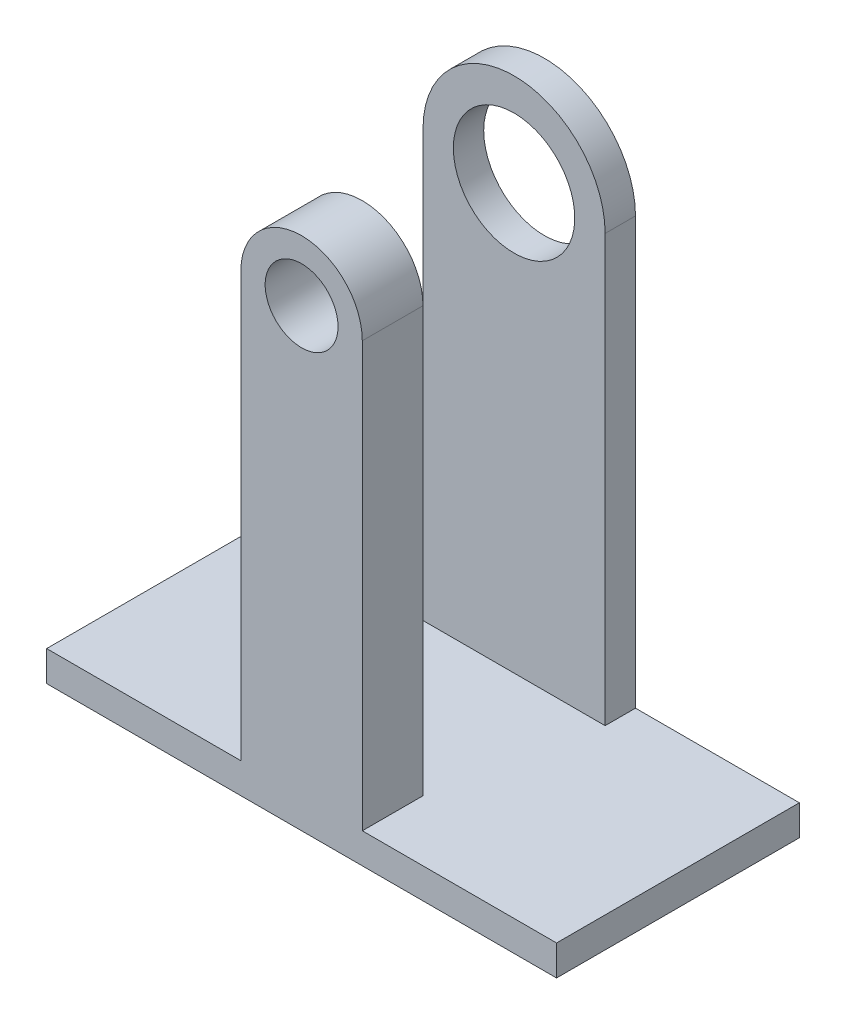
ISO-10303-21;
HEADER;
FILE_DESCRIPTION(('STEP AP214'),'2;1');
FILE_NAME('part.step','',(''),(''),'','','');
FILE_SCHEMA(('AUTOMOTIVE_DESIGN { 1 0 10303 214 1 1 1 1 }'));
ENDSEC;
DATA;
#1=APPLICATION_CONTEXT('core data for automotive mechanical design processes');
#2=APPLICATION_PROTOCOL_DEFINITION('international standard','automotive_design',2000,#1);
#3=PRODUCT_CONTEXT('',#1,'mechanical');
#4=PRODUCT('Part','Part','',(#3));
#5=PRODUCT_RELATED_PRODUCT_CATEGORY('part','',(#4));
#6=PRODUCT_DEFINITION_FORMATION('','',#4);
#7=PRODUCT_DEFINITION_CONTEXT('part definition',#1,'design');
#8=PRODUCT_DEFINITION('design','',#6,#7);
#9=PRODUCT_DEFINITION_SHAPE('','',#8);
#10=(LENGTH_UNIT() NAMED_UNIT(*) SI_UNIT(.MILLI.,.METRE.));
#11=(NAMED_UNIT(*) PLANE_ANGLE_UNIT() SI_UNIT($,.RADIAN.));
#12=(NAMED_UNIT(*) SI_UNIT($,.STERADIAN.) SOLID_ANGLE_UNIT());
#13=UNCERTAINTY_MEASURE_WITH_UNIT(LENGTH_MEASURE(1.E-05),#10,'distance_accuracy_value','');
#14=(GEOMETRIC_REPRESENTATION_CONTEXT(3) GLOBAL_UNCERTAINTY_ASSIGNED_CONTEXT((#13)) GLOBAL_UNIT_ASSIGNED_CONTEXT((#10,
#11,#12)) REPRESENTATION_CONTEXT('',''));
#15=CARTESIAN_POINT('',(0.,0.,0.));
#16=DIRECTION('',(0.,0.,1.));
#17=DIRECTION('',(1.,0.,0.));
#18=AXIS2_PLACEMENT_3D('',#15,#16,#17);
#19=CARTESIAN_POINT('',(0.,0.,10.));
#20=DIRECTION('',(0.,0.,1.));
#21=DIRECTION('',(1.,0.,0.));
#22=AXIS2_PLACEMENT_3D('',#19,#20,#21);
#23=PLANE('',#22);
#24=DIRECTION('',(0.,-1.,0.));
#25=VECTOR('',#24,1.);
#26=CARTESIAN_POINT('',(-10.,0.,10.));
#27=LINE('',#26,#25);
#28=CARTESIAN_POINT('',(-10.,0.,10.));
#29=VERTEX_POINT('',#28);
#30=CARTESIAN_POINT('',(-9.99999999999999,-69.911627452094,10.));
#31=VERTEX_POINT('',#30);
#32=EDGE_CURVE('E207',#29,#31,#27,.T.);
#33=ORIENTED_EDGE('',*,*,#32,.T.);
#34=DIRECTION('',(-1.,0.,0.));
#35=VECTOR('',#34,1.);
#36=CARTESIAN_POINT('',(-42.,-69.911627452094,10.));
#37=LINE('',#36,#35);
#38=CARTESIAN_POINT('',(-42.,-69.911627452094,10.));
#39=VERTEX_POINT('',#38);
#40=EDGE_CURVE('E179',#31,#39,#37,.T.);
#41=ORIENTED_EDGE('',*,*,#40,.T.);
#42=DIRECTION('',(0.,-1.,0.));
#43=VECTOR('',#42,1.);
#44=CARTESIAN_POINT('',(-42.,-74.911627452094,10.));
#45=LINE('',#44,#43);
#46=CARTESIAN_POINT('',(-42.,-74.911627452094,10.));
#47=VERTEX_POINT('',#46);
#48=EDGE_CURVE('E170',#39,#47,#45,.T.);
#49=ORIENTED_EDGE('',*,*,#48,.T.);
#50=DIRECTION('',(1.,0.,0.));
#51=VECTOR('',#50,1.);
#52=CARTESIAN_POINT('',(-42.,-74.911627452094,10.));
#53=LINE('',#52,#51);
#54=CARTESIAN_POINT('',(42.,-74.911627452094,10.));
#55=VERTEX_POINT('',#54);
#56=EDGE_CURVE('E173',#47,#55,#53,.T.);
#57=ORIENTED_EDGE('',*,*,#56,.T.);
#58=DIRECTION('',(0.,1.,0.));
#59=VECTOR('',#58,1.);
#60=CARTESIAN_POINT('',(42.,-74.911627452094,10.));
#61=LINE('',#60,#59);
#62=CARTESIAN_POINT('',(42.,-69.911627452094,10.));
#63=VERTEX_POINT('',#62);
#64=EDGE_CURVE('E176',#55,#63,#61,.T.);
#65=ORIENTED_EDGE('',*,*,#64,.T.);
#66=CARTESIAN_POINT('',(10.,-69.911627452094,10.));
#67=VERTEX_POINT('',#66);
#68=EDGE_CURVE('E180',#63,#67,#37,.T.);
#69=ORIENTED_EDGE('',*,*,#68,.T.);
#70=DIRECTION('',(0.,1.,0.));
#71=VECTOR('',#70,1.);
#72=CARTESIAN_POINT('',(10.,0.,10.));
#73=LINE('',#72,#71);
#74=CARTESIAN_POINT('',(10.,0.,10.));
#75=VERTEX_POINT('',#74);
#76=EDGE_CURVE('E59',#67,#75,#73,.T.);
#77=ORIENTED_EDGE('',*,*,#76,.T.);
#78=CARTESIAN_POINT('',(0.,0.,10.));
#79=DIRECTION('',(0.,0.,1.));
#80=DIRECTION('',(1.,0.,0.));
#81=AXIS2_PLACEMENT_3D('',#78,#79,#80);
#82=CIRCLE('',#81,10.);
#83=EDGE_CURVE('E44',#75,#29,#82,.T.);
#84=ORIENTED_EDGE('',*,*,#83,.T.);
#85=EDGE_LOOP('',(#33,#41,#49,#57,#65,#69,#77,#84));
#86=FACE_BOUND('',#85,.T.);
#87=CARTESIAN_POINT('',(0.,0.,10.));
#88=DIRECTION('',(0.,0.,1.));
#89=DIRECTION('',(1.,0.,0.));
#90=AXIS2_PLACEMENT_3D('',#87,#88,#89);
#91=CIRCLE('',#90,6.);
#92=CARTESIAN_POINT('',(6.,0.,10.));
#93=VERTEX_POINT('',#92);
#94=EDGE_CURVE('E224',#93,#93,#91,.T.);
#95=ORIENTED_EDGE('',*,*,#94,.F.);
#96=EDGE_LOOP('',(#95));
#97=FACE_BOUND('',#96,.T.);
#98=ADVANCED_FACE('F36',(#86,#97),#23,.T.);
#99=CARTESIAN_POINT('',(0.,0.,0.));
#100=DIRECTION('',(0.,0.,1.));
#101=DIRECTION('',(1.,0.,0.));
#102=AXIS2_PLACEMENT_3D('',#99,#100,#101);
#103=PLANE('',#102);
#104=DIRECTION('',(0.,1.,0.));
#105=VECTOR('',#104,1.);
#106=CARTESIAN_POINT('',(10.,0.,0.));
#107=LINE('',#106,#105);
#108=CARTESIAN_POINT('',(10.,-69.911627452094,0.));
#109=VERTEX_POINT('',#108);
#110=CARTESIAN_POINT('',(10.,0.,0.));
#111=VERTEX_POINT('',#110);
#112=EDGE_CURVE('E214',#109,#111,#107,.T.);
#113=ORIENTED_EDGE('',*,*,#112,.F.);
#114=DIRECTION('',(-1.,0.,0.));
#115=VECTOR('',#114,1.);
#116=CARTESIAN_POINT('',(0.,-69.911627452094,0.));
#117=LINE('',#116,#115);
#118=CARTESIAN_POINT('',(-9.99999999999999,-69.911627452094,0.));
#119=VERTEX_POINT('',#118);
#120=EDGE_CURVE('E197',#109,#119,#117,.T.);
#121=ORIENTED_EDGE('',*,*,#120,.T.);
#122=DIRECTION('',(0.,-1.,0.));
#123=VECTOR('',#122,1.);
#124=CARTESIAN_POINT('',(-10.,0.,0.));
#125=LINE('',#124,#123);
#126=CARTESIAN_POINT('',(-10.,0.,0.));
#127=VERTEX_POINT('',#126);
#128=EDGE_CURVE('E211',#127,#119,#125,.T.);
#129=ORIENTED_EDGE('',*,*,#128,.F.);
#130=CARTESIAN_POINT('',(0.,0.,0.));
#131=DIRECTION('',(0.,0.,1.));
#132=DIRECTION('',(1.,0.,0.));
#133=AXIS2_PLACEMENT_3D('',#130,#131,#132);
#134=CIRCLE('',#133,10.);
#135=EDGE_CURVE('E228',#111,#127,#134,.T.);
#136=ORIENTED_EDGE('',*,*,#135,.F.);
#137=EDGE_LOOP('',(#113,#121,#129,#136));
#138=FACE_BOUND('',#137,.T.);
#139=CARTESIAN_POINT('',(0.,0.,0.));
#140=DIRECTION('',(0.,0.,1.));
#141=DIRECTION('',(1.,0.,0.));
#142=AXIS2_PLACEMENT_3D('',#139,#140,#141);
#143=CIRCLE('',#142,6.);
#144=CARTESIAN_POINT('',(6.,0.,0.));
#145=VERTEX_POINT('',#144);
#146=EDGE_CURVE('E219',#145,#145,#143,.T.);
#147=ORIENTED_EDGE('',*,*,#146,.T.);
#148=EDGE_LOOP('',(#147));
#149=FACE_BOUND('',#148,.T.);
#150=ADVANCED_FACE('F241',(#138,#149),#103,.F.);
#151=CARTESIAN_POINT('',(0.,0.,10.));
#152=DIRECTION('',(0.,0.,-1.));
#153=DIRECTION('',(-1.,0.,0.));
#154=AXIS2_PLACEMENT_3D('',#151,#152,#153);
#155=CYLINDRICAL_SURFACE('',#154,10.);
#156=ORIENTED_EDGE('',*,*,#83,.F.);
#157=DIRECTION('',(0.,0.,1.));
#158=VECTOR('',#157,1.);
#159=CARTESIAN_POINT('',(10.,0.,0.));
#160=LINE('',#159,#158);
#161=EDGE_CURVE('E217',#111,#75,#160,.T.);
#162=ORIENTED_EDGE('',*,*,#161,.F.);
#163=ORIENTED_EDGE('',*,*,#135,.T.);
#164=DIRECTION('',(0.,0.,1.));
#165=VECTOR('',#164,1.);
#166=CARTESIAN_POINT('',(-10.,0.,0.));
#167=LINE('',#166,#165);
#168=EDGE_CURVE('E216',#127,#29,#167,.T.);
#169=ORIENTED_EDGE('',*,*,#168,.T.);
#170=EDGE_LOOP('',(#156,#162,#163,#169));
#171=FACE_BOUND('',#170,.T.);
#172=ADVANCED_FACE('F38',(#171),#155,.T.);
#173=CARTESIAN_POINT('',(0.,0.,10.));
#174=DIRECTION('',(0.,0.,-1.));
#175=DIRECTION('',(-1.,0.,0.));
#176=AXIS2_PLACEMENT_3D('',#173,#174,#175);
#177=CYLINDRICAL_SURFACE('',#176,6.);
#178=ORIENTED_EDGE('',*,*,#94,.T.);
#179=EDGE_LOOP('',(#178));
#180=FACE_BOUND('',#179,.T.);
#181=ORIENTED_EDGE('',*,*,#146,.F.);
#182=EDGE_LOOP('',(#181));
#183=FACE_BOUND('',#182,.T.);
#184=ADVANCED_FACE('F250',(#180,#183),#177,.F.);
#185=CARTESIAN_POINT('',(10.,0.,0.));
#186=DIRECTION('',(1.,0.,0.));
#187=DIRECTION('',(0.,1.,0.));
#188=AXIS2_PLACEMENT_3D('',#185,#186,#187);
#189=PLANE('',#188);
#190=DIRECTION('',(0.,0.,1.));
#191=VECTOR('',#190,1.);
#192=CARTESIAN_POINT('',(10.,-69.911627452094,0.));
#193=LINE('',#192,#191);
#194=EDGE_CURVE('E205',#109,#67,#193,.T.);
#195=ORIENTED_EDGE('',*,*,#194,.F.);
#196=ORIENTED_EDGE('',*,*,#112,.T.);
#197=ORIENTED_EDGE('',*,*,#161,.T.);
#198=ORIENTED_EDGE('',*,*,#76,.F.);
#199=EDGE_LOOP('',(#195,#196,#197,#198));
#200=FACE_BOUND('',#199,.T.);
#201=ADVANCED_FACE('F248',(#200),#189,.T.);
#202=CARTESIAN_POINT('',(-10.,0.,0.));
#203=DIRECTION('',(-1.,0.,0.));
#204=DIRECTION('',(0.,-1.,0.));
#205=AXIS2_PLACEMENT_3D('',#202,#203,#204);
#206=PLANE('',#205);
#207=DIRECTION('',(0.,0.,-1.));
#208=VECTOR('',#207,1.);
#209=CARTESIAN_POINT('',(-9.99999999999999,-69.911627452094,0.));
#210=LINE('',#209,#208);
#211=EDGE_CURVE('E11',#31,#119,#210,.T.);
#212=ORIENTED_EDGE('',*,*,#211,.F.);
#213=ORIENTED_EDGE('',*,*,#32,.F.);
#214=ORIENTED_EDGE('',*,*,#168,.F.);
#215=ORIENTED_EDGE('',*,*,#128,.T.);
#216=EDGE_LOOP('',(#212,#213,#214,#215));
#217=FACE_BOUND('',#216,.T.);
#218=ADVANCED_FACE('F238',(#217),#206,.T.);
#219=CARTESIAN_POINT('',(-42.,-74.911627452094,-30.));
#220=DIRECTION('',(-1.,0.,0.));
#221=DIRECTION('',(0.,-1.,0.));
#222=AXIS2_PLACEMENT_3D('',#219,#220,#221);
#223=PLANE('',#222);
#224=ORIENTED_EDGE('',*,*,#48,.F.);
#225=DIRECTION('',(0.,0.,1.));
#226=VECTOR('',#225,1.);
#227=CARTESIAN_POINT('',(-42.,-69.911627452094,-30.));
#228=LINE('',#227,#226);
#229=CARTESIAN_POINT('',(-42.,-69.911627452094,-30.));
#230=VERTEX_POINT('',#229);
#231=EDGE_CURVE('E194',#230,#39,#228,.T.);
#232=ORIENTED_EDGE('',*,*,#231,.F.);
#233=DIRECTION('',(0.,-1.,0.));
#234=VECTOR('',#233,1.);
#235=CARTESIAN_POINT('',(-42.,-74.911627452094,-30.));
#236=LINE('',#235,#234);
#237=CARTESIAN_POINT('',(-42.,-74.911627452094,-30.));
#238=VERTEX_POINT('',#237);
#239=EDGE_CURVE('E182',#230,#238,#236,.T.);
#240=ORIENTED_EDGE('',*,*,#239,.T.);
#241=DIRECTION('',(0.,0.,1.));
#242=VECTOR('',#241,1.);
#243=CARTESIAN_POINT('',(-42.,-74.911627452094,-30.));
#244=LINE('',#243,#242);
#245=EDGE_CURVE('E193',#238,#47,#244,.T.);
#246=ORIENTED_EDGE('',*,*,#245,.T.);
#247=EDGE_LOOP('',(#224,#232,#240,#246));
#248=FACE_BOUND('',#247,.T.);
#249=ADVANCED_FACE('F256',(#248),#223,.T.);
#250=CARTESIAN_POINT('',(-42.,-69.911627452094,-30.));
#251=DIRECTION('',(0.,1.,0.));
#252=DIRECTION('',(0.,0.,1.));
#253=AXIS2_PLACEMENT_3D('',#250,#251,#252);
#254=PLANE('',#253);
#255=DIRECTION('',(0.,0.,-1.));
#256=VECTOR('',#255,1.);
#257=CARTESIAN_POINT('',(15.0037322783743,-69.911627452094,-30.));
#258=LINE('',#257,#256);
#259=CARTESIAN_POINT('',(15.0037322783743,-69.911627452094,-25.));
#260=VERTEX_POINT('',#259);
#261=CARTESIAN_POINT('',(15.0037322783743,-69.911627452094,-30.));
#262=VERTEX_POINT('',#261);
#263=EDGE_CURVE('E143',#260,#262,#258,.T.);
#264=ORIENTED_EDGE('',*,*,#263,.F.);
#265=DIRECTION('',(-1.,0.,0.));
#266=VECTOR('',#265,1.);
#267=CARTESIAN_POINT('',(-42.,-69.911627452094,-25.));
#268=LINE('',#267,#266);
#269=CARTESIAN_POINT('',(-14.9962677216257,-69.911627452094,-25.));
#270=VERTEX_POINT('',#269);
#271=EDGE_CURVE('E167',#260,#270,#268,.T.);
#272=ORIENTED_EDGE('',*,*,#271,.T.);
#273=DIRECTION('',(0.,0.,1.));
#274=VECTOR('',#273,1.);
#275=CARTESIAN_POINT('',(-14.9962677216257,-69.911627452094,-30.));
#276=LINE('',#275,#274);
#277=CARTESIAN_POINT('',(-14.9962677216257,-69.911627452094,-30.));
#278=VERTEX_POINT('',#277);
#279=EDGE_CURVE('E163',#278,#270,#276,.T.);
#280=ORIENTED_EDGE('',*,*,#279,.F.);
#281=DIRECTION('',(-1.,0.,0.));
#282=VECTOR('',#281,1.);
#283=CARTESIAN_POINT('',(-42.,-69.911627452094,-30.));
#284=LINE('',#283,#282);
#285=EDGE_CURVE('E190',#278,#230,#284,.T.);
#286=ORIENTED_EDGE('',*,*,#285,.T.);
#287=ORIENTED_EDGE('',*,*,#231,.T.);
#288=ORIENTED_EDGE('',*,*,#40,.F.);
#289=ORIENTED_EDGE('',*,*,#211,.T.);
#290=ORIENTED_EDGE('',*,*,#120,.F.);
#291=ORIENTED_EDGE('',*,*,#194,.T.);
#292=ORIENTED_EDGE('',*,*,#68,.F.);
#293=DIRECTION('',(0.,0.,1.));
#294=VECTOR('',#293,1.);
#295=CARTESIAN_POINT('',(42.,-69.911627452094,-30.));
#296=LINE('',#295,#294);
#297=CARTESIAN_POINT('',(42.,-69.911627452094,-30.));
#298=VERTEX_POINT('',#297);
#299=EDGE_CURVE('E198',#298,#63,#296,.T.);
#300=ORIENTED_EDGE('',*,*,#299,.F.);
#301=EDGE_CURVE('E191',#298,#262,#284,.T.);
#302=ORIENTED_EDGE('',*,*,#301,.T.);
#303=EDGE_LOOP('',(#264,#272,#280,#286,#287,#288,#289,#290,#291,#292,#300,#302));
#304=FACE_BOUND('',#303,.T.);
#305=ADVANCED_FACE('F245',(#304),#254,.T.);
#306=CARTESIAN_POINT('',(42.,-74.911627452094,-30.));
#307=DIRECTION('',(1.,0.,0.));
#308=DIRECTION('',(0.,1.,0.));
#309=AXIS2_PLACEMENT_3D('',#306,#307,#308);
#310=PLANE('',#309);
#311=ORIENTED_EDGE('',*,*,#64,.F.);
#312=DIRECTION('',(0.,0.,1.));
#313=VECTOR('',#312,1.);
#314=CARTESIAN_POINT('',(42.,-74.911627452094,-30.));
#315=LINE('',#314,#313);
#316=CARTESIAN_POINT('',(42.,-74.911627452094,-30.));
#317=VERTEX_POINT('',#316);
#318=EDGE_CURVE('E200',#317,#55,#315,.T.);
#319=ORIENTED_EDGE('',*,*,#318,.F.);
#320=DIRECTION('',(0.,1.,0.));
#321=VECTOR('',#320,1.);
#322=CARTESIAN_POINT('',(42.,-74.911627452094,-30.));
#323=LINE('',#322,#321);
#324=EDGE_CURVE('E187',#317,#298,#323,.T.);
#325=ORIENTED_EDGE('',*,*,#324,.T.);
#326=ORIENTED_EDGE('',*,*,#299,.T.);
#327=EDGE_LOOP('',(#311,#319,#325,#326));
#328=FACE_BOUND('',#327,.T.);
#329=ADVANCED_FACE('F358',(#328),#310,.T.);
#330=CARTESIAN_POINT('',(-42.,-74.911627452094,-30.));
#331=DIRECTION('',(0.,-1.,0.));
#332=DIRECTION('',(0.,0.,-1.));
#333=AXIS2_PLACEMENT_3D('',#330,#331,#332);
#334=PLANE('',#333);
#335=DIRECTION('',(1.,0.,0.));
#336=VECTOR('',#335,1.);
#337=CARTESIAN_POINT('',(-42.,-74.911627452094,-30.));
#338=LINE('',#337,#336);
#339=EDGE_CURVE('E185',#238,#317,#338,.T.);
#340=ORIENTED_EDGE('',*,*,#339,.T.);
#341=ORIENTED_EDGE('',*,*,#318,.T.);
#342=ORIENTED_EDGE('',*,*,#56,.F.);
#343=ORIENTED_EDGE('',*,*,#245,.F.);
#344=EDGE_LOOP('',(#340,#341,#342,#343));
#345=FACE_BOUND('',#344,.T.);
#346=ADVANCED_FACE('F295',(#345),#334,.T.);
#347=CARTESIAN_POINT('',(-42.,-69.911627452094,-30.));
#348=DIRECTION('',(0.,0.,-1.));
#349=DIRECTION('',(-1.,0.,0.));
#350=AXIS2_PLACEMENT_3D('',#347,#348,#349);
#351=PLANE('',#350);
#352=ORIENTED_EDGE('',*,*,#285,.F.);
#353=DIRECTION('',(0.,1.,0.));
#354=VECTOR('',#353,1.);
#355=CARTESIAN_POINT('',(-14.9962677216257,0.311059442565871,-30.));
#356=LINE('',#355,#354);
#357=CARTESIAN_POINT('',(-14.9962677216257,0.311059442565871,-30.));
#358=VERTEX_POINT('',#357);
#359=EDGE_CURVE('E137',#278,#358,#356,.T.);
#360=ORIENTED_EDGE('',*,*,#359,.T.);
#361=CARTESIAN_POINT('',(0.00373227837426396,0.311059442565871,-30.));
#362=DIRECTION('',(0.,0.,-1.));
#363=DIRECTION('',(-1.,0.,0.));
#364=AXIS2_PLACEMENT_3D('',#361,#362,#363);
#365=CIRCLE('',#364,15.);
#366=CARTESIAN_POINT('',(15.0037322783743,0.311059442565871,-30.));
#367=VERTEX_POINT('',#366);
#368=EDGE_CURVE('E132',#358,#367,#365,.T.);
#369=ORIENTED_EDGE('',*,*,#368,.T.);
#370=DIRECTION('',(0.,-1.,0.));
#371=VECTOR('',#370,1.);
#372=CARTESIAN_POINT('',(15.0037322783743,0.311059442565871,-30.));
#373=LINE('',#372,#371);
#374=EDGE_CURVE('E140',#367,#262,#373,.T.);
#375=ORIENTED_EDGE('',*,*,#374,.T.);
#376=ORIENTED_EDGE('',*,*,#301,.F.);
#377=ORIENTED_EDGE('',*,*,#324,.F.);
#378=ORIENTED_EDGE('',*,*,#339,.F.);
#379=ORIENTED_EDGE('',*,*,#239,.F.);
#380=EDGE_LOOP('',(#352,#360,#369,#375,#376,#377,#378,#379));
#381=FACE_BOUND('',#380,.T.);
#382=CARTESIAN_POINT('',(0.,0.,-30.));
#383=DIRECTION('',(0.,0.,-1.));
#384=DIRECTION('',(-1.,0.,0.));
#385=AXIS2_PLACEMENT_3D('',#382,#383,#384);
#386=CIRCLE('',#385,10.);
#387=CARTESIAN_POINT('',(-10.,0.,-30.));
#388=VERTEX_POINT('',#387);
#389=EDGE_CURVE('E152',#388,#388,#386,.T.);
#390=ORIENTED_EDGE('',*,*,#389,.F.);
#391=EDGE_LOOP('',(#390));
#392=FACE_BOUND('',#391,.T.);
#393=ADVANCED_FACE('F149',(#381,#392),#351,.T.);
#394=CARTESIAN_POINT('',(15.0037322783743,0.311059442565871,70.0796152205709));
#395=DIRECTION('',(1.,0.,0.));
#396=DIRECTION('',(0.,1.,0.));
#397=AXIS2_PLACEMENT_3D('',#394,#395,#396);
#398=PLANE('',#397);
#399=DIRECTION('',(0.,1.,0.));
#400=VECTOR('',#399,1.);
#401=CARTESIAN_POINT('',(15.0037322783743,0.311059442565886,-25.));
#402=LINE('',#401,#400);
#403=CARTESIAN_POINT('',(15.0037322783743,0.311059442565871,-25.));
#404=VERTEX_POINT('',#403);
#405=EDGE_CURVE('E164',#260,#404,#402,.T.);
#406=ORIENTED_EDGE('',*,*,#405,.F.);
#407=ORIENTED_EDGE('',*,*,#263,.T.);
#408=ORIENTED_EDGE('',*,*,#374,.F.);
#409=DIRECTION('',(0.,0.,-1.));
#410=VECTOR('',#409,1.);
#411=CARTESIAN_POINT('',(15.0037322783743,0.311059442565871,70.0796152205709));
#412=LINE('',#411,#410);
#413=EDGE_CURVE('E127',#404,#367,#412,.T.);
#414=ORIENTED_EDGE('',*,*,#413,.F.);
#415=EDGE_LOOP('',(#406,#407,#408,#414));
#416=FACE_BOUND('',#415,.T.);
#417=ADVANCED_FACE('F141',(#416),#398,.T.);
#418=CARTESIAN_POINT('',(-14.9962677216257,0.311059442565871,70.0796152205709));
#419=DIRECTION('',(-1.,0.,0.));
#420=DIRECTION('',(0.,0.,1.));
#421=AXIS2_PLACEMENT_3D('',#418,#419,#420);
#422=PLANE('',#421);
#423=ORIENTED_EDGE('',*,*,#359,.F.);
#424=ORIENTED_EDGE('',*,*,#279,.T.);
#425=DIRECTION('',(0.,-1.,0.));
#426=VECTOR('',#425,1.);
#427=CARTESIAN_POINT('',(-14.9962677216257,0.311059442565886,-25.));
#428=LINE('',#427,#426);
#429=CARTESIAN_POINT('',(-14.9962677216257,0.311059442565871,-25.));
#430=VERTEX_POINT('',#429);
#431=EDGE_CURVE('E51',#430,#270,#428,.T.);
#432=ORIENTED_EDGE('',*,*,#431,.F.);
#433=DIRECTION('',(0.,0.,-1.));
#434=VECTOR('',#433,1.);
#435=CARTESIAN_POINT('',(-14.9962677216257,0.311059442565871,70.0796152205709));
#436=LINE('',#435,#434);
#437=EDGE_CURVE('E136',#430,#358,#436,.T.);
#438=ORIENTED_EDGE('',*,*,#437,.T.);
#439=EDGE_LOOP('',(#423,#424,#432,#438));
#440=FACE_BOUND('',#439,.T.);
#441=ADVANCED_FACE('F308',(#440),#422,.T.);
#442=CARTESIAN_POINT('',(0.00373227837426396,0.311059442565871,70.0796152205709));
#443=DIRECTION('',(0.,0.,-1.));
#444=DIRECTION('',(-1.,0.,0.));
#445=AXIS2_PLACEMENT_3D('',#442,#443,#444);
#446=CYLINDRICAL_SURFACE('',#445,15.);
#447=CARTESIAN_POINT('',(0.00373227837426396,0.311059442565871,-25.));
#448=DIRECTION('',(0.,0.,-1.));
#449=DIRECTION('',(0.,1.,0.));
#450=AXIS2_PLACEMENT_3D('',#447,#448,#449);
#451=CIRCLE('',#450,15.);
#452=EDGE_CURVE('E133',#404,#430,#451,.F.);
#453=ORIENTED_EDGE('',*,*,#452,.F.);
#454=ORIENTED_EDGE('',*,*,#413,.T.);
#455=ORIENTED_EDGE('',*,*,#368,.F.);
#456=ORIENTED_EDGE('',*,*,#437,.F.);
#457=EDGE_LOOP('',(#453,#454,#455,#456));
#458=FACE_BOUND('',#457,.T.);
#459=ADVANCED_FACE('F129',(#458),#446,.T.);
#460=CARTESIAN_POINT('',(0.,0.,70.0796152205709));
#461=DIRECTION('',(0.,0.,-1.));
#462=DIRECTION('',(-1.,0.,0.));
#463=AXIS2_PLACEMENT_3D('',#460,#461,#462);
#464=CYLINDRICAL_SURFACE('',#463,10.);
#465=CARTESIAN_POINT('',(0.,0.,-25.));
#466=DIRECTION('',(0.,0.,-1.));
#467=DIRECTION('',(0.,1.,0.));
#468=AXIS2_PLACEMENT_3D('',#465,#466,#467);
#469=CIRCLE('',#468,10.);
#470=CARTESIAN_POINT('',(0.,10.,-25.));
#471=VERTEX_POINT('',#470);
#472=EDGE_CURVE('E160',#471,#471,#469,.F.);
#473=ORIENTED_EDGE('',*,*,#472,.T.);
#474=EDGE_LOOP('',(#473));
#475=FACE_BOUND('',#474,.T.);
#476=ORIENTED_EDGE('',*,*,#389,.T.);
#477=EDGE_LOOP('',(#476));
#478=FACE_BOUND('',#477,.T.);
#479=ADVANCED_FACE('F322',(#475,#478),#464,.F.);
#480=CARTESIAN_POINT('',(0.,0.,-25.));
#481=DIRECTION('',(0.,0.,-1.));
#482=DIRECTION('',(-0.404480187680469,-0.914546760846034,0.));
#483=AXIS2_PLACEMENT_3D('',#480,#481,#482);
#484=PLANE('',#483);
#485=ORIENTED_EDGE('',*,*,#271,.F.);
#486=ORIENTED_EDGE('',*,*,#405,.T.);
#487=ORIENTED_EDGE('',*,*,#452,.T.);
#488=ORIENTED_EDGE('',*,*,#431,.T.);
#489=EDGE_LOOP('',(#485,#486,#487,#488));
#490=FACE_BOUND('',#489,.T.);
#491=ORIENTED_EDGE('',*,*,#472,.F.);
#492=EDGE_LOOP('',(#491));
#493=FACE_BOUND('',#492,.T.);
#494=ADVANCED_FACE('F329',(#490,#493),#484,.F.);
#495=CLOSED_SHELL('',(#98,#150,#172,#184,#201,#218,#249,#305,#329,#346,#393,#417,#441,#459,#479,#494));
#496=MANIFOLD_SOLID_BREP('B2',#495);
#497=ADVANCED_BREP_SHAPE_REPRESENTATION('',(#18,#496),#14);
#498=SHAPE_DEFINITION_REPRESENTATION(#9,#497);
ENDSEC;
END-ISO-10303-21;
